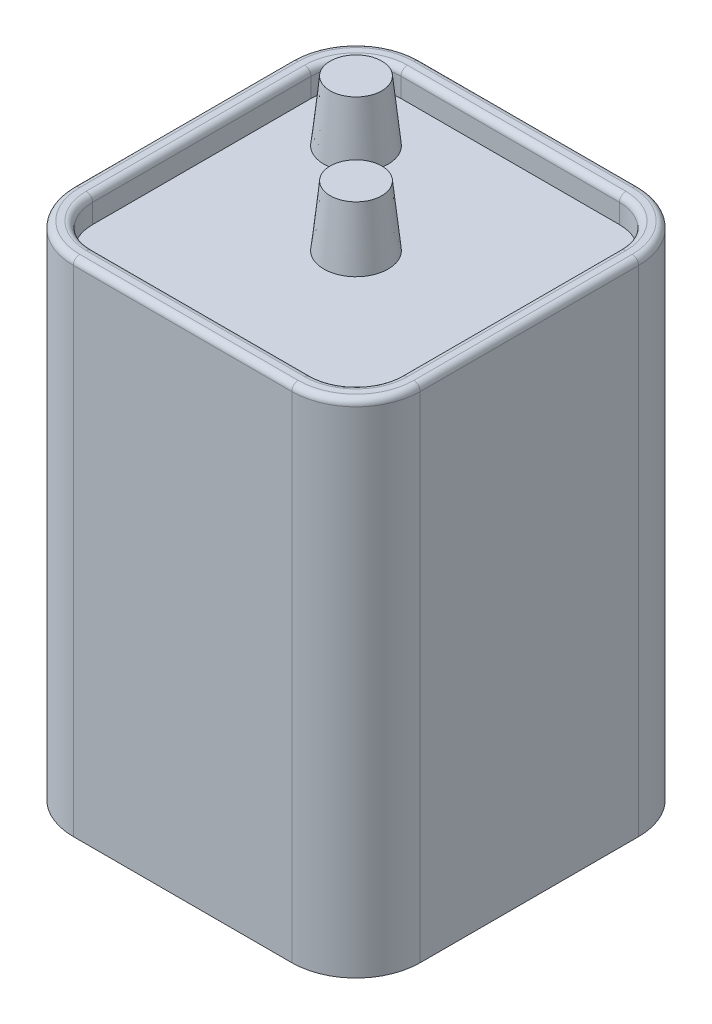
ISO-10303-21;
HEADER;
FILE_DESCRIPTION(('STEP AP214'),'2;1');
FILE_NAME('part.step','',(''),(''),'','','');
FILE_SCHEMA(('AUTOMOTIVE_DESIGN { 1 0 10303 214 1 1 1 1 }'));
ENDSEC;
DATA;
#1=APPLICATION_CONTEXT('core data for automotive mechanical design processes');
#2=APPLICATION_PROTOCOL_DEFINITION('international standard','automotive_design',2000,#1);
#3=PRODUCT_CONTEXT('',#1,'mechanical');
#4=PRODUCT('Part','Part','',(#3));
#5=PRODUCT_RELATED_PRODUCT_CATEGORY('part','',(#4));
#6=PRODUCT_DEFINITION_FORMATION('','',#4);
#7=PRODUCT_DEFINITION_CONTEXT('part definition',#1,'design');
#8=PRODUCT_DEFINITION('design','',#6,#7);
#9=PRODUCT_DEFINITION_SHAPE('','',#8);
#10=(LENGTH_UNIT() NAMED_UNIT(*) SI_UNIT(.MILLI.,.METRE.));
#11=(NAMED_UNIT(*) PLANE_ANGLE_UNIT() SI_UNIT($,.RADIAN.));
#12=(NAMED_UNIT(*) SI_UNIT($,.STERADIAN.) SOLID_ANGLE_UNIT());
#13=UNCERTAINTY_MEASURE_WITH_UNIT(LENGTH_MEASURE(1.E-05),#10,'distance_accuracy_value','');
#14=(GEOMETRIC_REPRESENTATION_CONTEXT(3) GLOBAL_UNCERTAINTY_ASSIGNED_CONTEXT((#13)) GLOBAL_UNIT_ASSIGNED_CONTEXT((#10,
#11,#12)) REPRESENTATION_CONTEXT('',''));
#15=CARTESIAN_POINT('',(0.,0.,0.));
#16=DIRECTION('',(0.,0.,1.));
#17=DIRECTION('',(1.,0.,0.));
#18=AXIS2_PLACEMENT_3D('',#15,#16,#17);
#19=CARTESIAN_POINT('',(34.29,99.06,34.29));
#20=DIRECTION('',(-1.,0.,0.));
#21=DIRECTION('',(0.,0.,1.));
#22=AXIS2_PLACEMENT_3D('',#19,#20,#21);
#23=PLANE('',#22);
#24=DIRECTION('',(0.,-1.,0.));
#25=VECTOR('',#24,1.);
#26=CARTESIAN_POINT('',(34.29,99.06,-21.59));
#27=LINE('',#26,#25);
#28=CARTESIAN_POINT('',(34.29,0.,-21.59));
#29=VERTEX_POINT('',#28);
#30=CARTESIAN_POINT('',(34.29,97.79,-21.59));
#31=VERTEX_POINT('',#30);
#32=EDGE_CURVE('E327',#29,#31,#27,.F.);
#33=ORIENTED_EDGE('',*,*,#32,.T.);
#34=DIRECTION('',(0.,0.,-1.));
#35=VECTOR('',#34,1.);
#36=CARTESIAN_POINT('',(34.29,97.79,34.29));
#37=LINE('',#36,#35);
#38=CARTESIAN_POINT('',(34.29,97.79,21.59));
#39=VERTEX_POINT('',#38);
#40=EDGE_CURVE('E395',#31,#39,#37,.F.);
#41=ORIENTED_EDGE('',*,*,#40,.T.);
#42=DIRECTION('',(0.,-1.,0.));
#43=VECTOR('',#42,1.);
#44=CARTESIAN_POINT('',(34.29,99.06,21.59));
#45=LINE('',#44,#43);
#46=CARTESIAN_POINT('',(34.29,0.,21.59));
#47=VERTEX_POINT('',#46);
#48=EDGE_CURVE('E331',#39,#47,#45,.T.);
#49=ORIENTED_EDGE('',*,*,#48,.T.);
#50=DIRECTION('',(0.,0.,-1.));
#51=VECTOR('',#50,1.);
#52=CARTESIAN_POINT('',(34.29,0.,34.29));
#53=LINE('',#52,#51);
#54=EDGE_CURVE('E264',#47,#29,#53,.T.);
#55=ORIENTED_EDGE('',*,*,#54,.T.);
#56=EDGE_LOOP('',(#33,#41,#49,#55));
#57=FACE_BOUND('',#56,.T.);
#58=ADVANCED_FACE('F45',(#57),#23,.F.);
#59=CARTESIAN_POINT('',(-34.29,99.06,-34.29));
#60=DIRECTION('',(0.,0.,1.));
#61=DIRECTION('',(1.,0.,0.));
#62=AXIS2_PLACEMENT_3D('',#59,#60,#61);
#63=PLANE('',#62);
#64=DIRECTION('',(0.,-1.,0.));
#65=VECTOR('',#64,1.);
#66=CARTESIAN_POINT('',(-21.59,99.06,-34.29));
#67=LINE('',#66,#65);
#68=CARTESIAN_POINT('',(-21.59,0.,-34.29));
#69=VERTEX_POINT('',#68);
#70=CARTESIAN_POINT('',(-21.59,97.79,-34.29));
#71=VERTEX_POINT('',#70);
#72=EDGE_CURVE('E323',#69,#71,#67,.F.);
#73=ORIENTED_EDGE('',*,*,#72,.T.);
#74=DIRECTION('',(-1.,0.,0.));
#75=VECTOR('',#74,1.);
#76=CARTESIAN_POINT('',(-34.29,97.79,-34.29));
#77=LINE('',#76,#75);
#78=CARTESIAN_POINT('',(21.59,97.79,-34.29));
#79=VERTEX_POINT('',#78);
#80=EDGE_CURVE('E413',#71,#79,#77,.F.);
#81=ORIENTED_EDGE('',*,*,#80,.T.);
#82=DIRECTION('',(0.,-1.,0.));
#83=VECTOR('',#82,1.);
#84=CARTESIAN_POINT('',(21.59,99.06,-34.29));
#85=LINE('',#84,#83);
#86=CARTESIAN_POINT('',(21.59,0.,-34.29));
#87=VERTEX_POINT('',#86);
#88=EDGE_CURVE('E320',#79,#87,#85,.T.);
#89=ORIENTED_EDGE('',*,*,#88,.T.);
#90=DIRECTION('',(-1.,0.,0.));
#91=VECTOR('',#90,1.);
#92=CARTESIAN_POINT('',(-34.29,0.,-34.29));
#93=LINE('',#92,#91);
#94=EDGE_CURVE('E289',#87,#69,#93,.T.);
#95=ORIENTED_EDGE('',*,*,#94,.T.);
#96=EDGE_LOOP('',(#73,#81,#89,#95));
#97=FACE_BOUND('',#96,.T.);
#98=ADVANCED_FACE('F537',(#97),#63,.F.);
#99=CARTESIAN_POINT('',(-34.29,99.06,34.29));
#100=DIRECTION('',(1.,0.,0.));
#101=DIRECTION('',(0.,0.,-1.));
#102=AXIS2_PLACEMENT_3D('',#99,#100,#101);
#103=PLANE('',#102);
#104=DIRECTION('',(0.,-1.,0.));
#105=VECTOR('',#104,1.);
#106=CARTESIAN_POINT('',(-34.29,99.06,21.59));
#107=LINE('',#106,#105);
#108=CARTESIAN_POINT('',(-34.29,0.,21.59));
#109=VERTEX_POINT('',#108);
#110=CARTESIAN_POINT('',(-34.29,97.79,21.59));
#111=VERTEX_POINT('',#110);
#112=EDGE_CURVE('E301',#109,#111,#107,.F.);
#113=ORIENTED_EDGE('',*,*,#112,.T.);
#114=DIRECTION('',(0.,0.,1.));
#115=VECTOR('',#114,1.);
#116=CARTESIAN_POINT('',(-34.29,97.79,34.29));
#117=LINE('',#116,#115);
#118=CARTESIAN_POINT('',(-34.29,97.79,-21.59));
#119=VERTEX_POINT('',#118);
#120=EDGE_CURVE('E407',#111,#119,#117,.F.);
#121=ORIENTED_EDGE('',*,*,#120,.T.);
#122=DIRECTION('',(0.,-1.,0.));
#123=VECTOR('',#122,1.);
#124=CARTESIAN_POINT('',(-34.29,99.06,-21.59));
#125=LINE('',#124,#123);
#126=CARTESIAN_POINT('',(-34.29,0.,-21.59));
#127=VERTEX_POINT('',#126);
#128=EDGE_CURVE('E305',#119,#127,#125,.T.);
#129=ORIENTED_EDGE('',*,*,#128,.T.);
#130=DIRECTION('',(0.,0.,1.));
#131=VECTOR('',#130,1.);
#132=CARTESIAN_POINT('',(-34.29,0.,34.29));
#133=LINE('',#132,#131);
#134=EDGE_CURVE('E293',#127,#109,#133,.T.);
#135=ORIENTED_EDGE('',*,*,#134,.T.);
#136=EDGE_LOOP('',(#113,#121,#129,#135));
#137=FACE_BOUND('',#136,.T.);
#138=ADVANCED_FACE('F544',(#137),#103,.F.);
#139=CARTESIAN_POINT('',(-34.29,99.06,34.29));
#140=DIRECTION('',(0.,0.,-1.));
#141=DIRECTION('',(-1.,0.,0.));
#142=AXIS2_PLACEMENT_3D('',#139,#140,#141);
#143=PLANE('',#142);
#144=DIRECTION('',(0.,-1.,0.));
#145=VECTOR('',#144,1.);
#146=CARTESIAN_POINT('',(21.59,99.06,34.29));
#147=LINE('',#146,#145);
#148=CARTESIAN_POINT('',(21.59,0.,34.29));
#149=VERTEX_POINT('',#148);
#150=CARTESIAN_POINT('',(21.59,97.79,34.29));
#151=VERTEX_POINT('',#150);
#152=EDGE_CURVE('E337',#149,#151,#147,.F.);
#153=ORIENTED_EDGE('',*,*,#152,.T.);
#154=DIRECTION('',(1.,0.,0.));
#155=VECTOR('',#154,1.);
#156=CARTESIAN_POINT('',(-34.29,97.79,34.29));
#157=LINE('',#156,#155);
#158=CARTESIAN_POINT('',(-21.59,97.79,34.29));
#159=VERTEX_POINT('',#158);
#160=EDGE_CURVE('E401',#151,#159,#157,.F.);
#161=ORIENTED_EDGE('',*,*,#160,.T.);
#162=DIRECTION('',(0.,-1.,0.));
#163=VECTOR('',#162,1.);
#164=CARTESIAN_POINT('',(-21.59,99.06,34.29));
#165=LINE('',#164,#163);
#166=CARTESIAN_POINT('',(-21.59,0.,34.29));
#167=VERTEX_POINT('',#166);
#168=EDGE_CURVE('E334',#159,#167,#165,.T.);
#169=ORIENTED_EDGE('',*,*,#168,.T.);
#170=DIRECTION('',(1.,0.,0.));
#171=VECTOR('',#170,1.);
#172=CARTESIAN_POINT('',(-34.29,0.,34.29));
#173=LINE('',#172,#171);
#174=EDGE_CURVE('E297',#167,#149,#173,.T.);
#175=ORIENTED_EDGE('',*,*,#174,.T.);
#176=EDGE_LOOP('',(#153,#161,#169,#175));
#177=FACE_BOUND('',#176,.T.);
#178=ADVANCED_FACE('F757',(#177),#143,.F.);
#179=CARTESIAN_POINT('',(0.,99.06,0.));
#180=DIRECTION('',(0.,-1.,0.));
#181=DIRECTION('',(0.,0.,-1.));
#182=AXIS2_PLACEMENT_3D('',#179,#180,#181);
#183=PLANE('',#182);
#184=DIRECTION('',(0.,0.,-1.));
#185=VECTOR('',#184,1.);
#186=CARTESIAN_POINT('',(33.02,99.06,0.));
#187=LINE('',#186,#185);
#188=CARTESIAN_POINT('',(33.02,99.06,21.59));
#189=VERTEX_POINT('',#188);
#190=CARTESIAN_POINT('',(33.02,99.06,-21.59));
#191=VERTEX_POINT('',#190);
#192=EDGE_CURVE('E384',#189,#191,#187,.T.);
#193=ORIENTED_EDGE('',*,*,#192,.T.);
#194=CARTESIAN_POINT('',(21.59,99.06,-21.59));
#195=DIRECTION('',(0.,-1.,0.));
#196=DIRECTION('',(0.,0.,-1.));
#197=AXIS2_PLACEMENT_3D('',#194,#195,#196);
#198=CIRCLE('',#197,11.43);
#199=CARTESIAN_POINT('',(21.59,99.06,-33.02));
#200=VERTEX_POINT('',#199);
#201=EDGE_CURVE('E387',#191,#200,#198,.F.);
#202=ORIENTED_EDGE('',*,*,#201,.T.);
#203=DIRECTION('',(-1.,0.,0.));
#204=VECTOR('',#203,1.);
#205=CARTESIAN_POINT('',(0.,99.06,-33.02));
#206=LINE('',#205,#204);
#207=CARTESIAN_POINT('',(-21.59,99.06,-33.02));
#208=VERTEX_POINT('',#207);
#209=EDGE_CURVE('E366',#200,#208,#206,.T.);
#210=ORIENTED_EDGE('',*,*,#209,.T.);
#211=CARTESIAN_POINT('',(-21.59,99.06,-21.59));
#212=DIRECTION('',(0.,-1.,0.));
#213=DIRECTION('',(0.,0.,-1.));
#214=AXIS2_PLACEMENT_3D('',#211,#212,#213);
#215=CIRCLE('',#214,11.43);
#216=CARTESIAN_POINT('',(-33.02,99.06,-21.59));
#217=VERTEX_POINT('',#216);
#218=EDGE_CURVE('E369',#208,#217,#215,.F.);
#219=ORIENTED_EDGE('',*,*,#218,.T.);
#220=DIRECTION('',(0.,0.,1.));
#221=VECTOR('',#220,1.);
#222=CARTESIAN_POINT('',(-33.02,99.06,0.));
#223=LINE('',#222,#221);
#224=CARTESIAN_POINT('',(-33.02,99.06,21.59));
#225=VERTEX_POINT('',#224);
#226=EDGE_CURVE('E372',#217,#225,#223,.T.);
#227=ORIENTED_EDGE('',*,*,#226,.T.);
#228=CARTESIAN_POINT('',(-21.59,99.06,21.59));
#229=DIRECTION('',(0.,-1.,0.));
#230=DIRECTION('',(0.,0.,-1.));
#231=AXIS2_PLACEMENT_3D('',#228,#229,#230);
#232=CIRCLE('',#231,11.43);
#233=CARTESIAN_POINT('',(-21.59,99.06,33.02));
#234=VERTEX_POINT('',#233);
#235=EDGE_CURVE('E375',#225,#234,#232,.F.);
#236=ORIENTED_EDGE('',*,*,#235,.T.);
#237=DIRECTION('',(1.,0.,0.));
#238=VECTOR('',#237,1.);
#239=CARTESIAN_POINT('',(0.,99.06,33.02));
#240=LINE('',#239,#238);
#241=CARTESIAN_POINT('',(21.59,99.06,33.02));
#242=VERTEX_POINT('',#241);
#243=EDGE_CURVE('E378',#234,#242,#240,.T.);
#244=ORIENTED_EDGE('',*,*,#243,.T.);
#245=CARTESIAN_POINT('',(21.59,99.06,21.59));
#246=DIRECTION('',(0.,-1.,0.));
#247=DIRECTION('',(0.,0.,-1.));
#248=AXIS2_PLACEMENT_3D('',#245,#246,#247);
#249=CIRCLE('',#248,11.43);
#250=EDGE_CURVE('E381',#242,#189,#249,.F.);
#251=ORIENTED_EDGE('',*,*,#250,.T.);
#252=EDGE_LOOP('',(#193,#202,#210,#219,#227,#236,#244,#251));
#253=FACE_BOUND('',#252,.T.);
#254=DIRECTION('',(0.,0.,1.));
#255=VECTOR('',#254,1.);
#256=CARTESIAN_POINT('',(-31.75,99.06,0.));
#257=LINE('',#256,#255);
#258=CARTESIAN_POINT('',(-31.75,99.06,21.59));
#259=VERTEX_POINT('',#258);
#260=CARTESIAN_POINT('',(-31.75,99.06,-21.59));
#261=VERTEX_POINT('',#260);
#262=EDGE_CURVE('E359',#259,#261,#257,.F.);
#263=ORIENTED_EDGE('',*,*,#262,.T.);
#264=CARTESIAN_POINT('',(-21.59,99.06,-21.59));
#265=DIRECTION('',(0.,-1.,0.));
#266=DIRECTION('',(0.,0.,-1.));
#267=AXIS2_PLACEMENT_3D('',#264,#265,#266);
#268=CIRCLE('',#267,10.16);
#269=CARTESIAN_POINT('',(-21.59,99.06,-31.75));
#270=VERTEX_POINT('',#269);
#271=EDGE_CURVE('E362',#261,#270,#268,.T.);
#272=ORIENTED_EDGE('',*,*,#271,.T.);
#273=DIRECTION('',(-1.,0.,0.));
#274=VECTOR('',#273,1.);
#275=CARTESIAN_POINT('',(0.,99.06,-31.75));
#276=LINE('',#275,#274);
#277=CARTESIAN_POINT('',(21.59,99.06,-31.75));
#278=VERTEX_POINT('',#277);
#279=EDGE_CURVE('E341',#270,#278,#276,.F.);
#280=ORIENTED_EDGE('',*,*,#279,.T.);
#281=CARTESIAN_POINT('',(21.59,99.06,-21.59));
#282=DIRECTION('',(0.,-1.,0.));
#283=DIRECTION('',(0.,0.,-1.));
#284=AXIS2_PLACEMENT_3D('',#281,#282,#283);
#285=CIRCLE('',#284,10.16);
#286=CARTESIAN_POINT('',(31.75,99.06,-21.59));
#287=VERTEX_POINT('',#286);
#288=EDGE_CURVE('E344',#278,#287,#285,.T.);
#289=ORIENTED_EDGE('',*,*,#288,.T.);
#290=DIRECTION('',(0.,0.,-1.));
#291=VECTOR('',#290,1.);
#292=CARTESIAN_POINT('',(31.75,99.06,0.));
#293=LINE('',#292,#291);
#294=CARTESIAN_POINT('',(31.75,99.06,21.59));
#295=VERTEX_POINT('',#294);
#296=EDGE_CURVE('E347',#287,#295,#293,.F.);
#297=ORIENTED_EDGE('',*,*,#296,.T.);
#298=CARTESIAN_POINT('',(21.59,99.06,21.59));
#299=DIRECTION('',(0.,-1.,0.));
#300=DIRECTION('',(0.,0.,-1.));
#301=AXIS2_PLACEMENT_3D('',#298,#299,#300);
#302=CIRCLE('',#301,10.16);
#303=CARTESIAN_POINT('',(21.59,99.06,31.75));
#304=VERTEX_POINT('',#303);
#305=EDGE_CURVE('E350',#295,#304,#302,.T.);
#306=ORIENTED_EDGE('',*,*,#305,.T.);
#307=DIRECTION('',(1.,0.,0.));
#308=VECTOR('',#307,1.);
#309=CARTESIAN_POINT('',(0.,99.06,31.75));
#310=LINE('',#309,#308);
#311=CARTESIAN_POINT('',(-21.59,99.06,31.75));
#312=VERTEX_POINT('',#311);
#313=EDGE_CURVE('E353',#304,#312,#310,.F.);
#314=ORIENTED_EDGE('',*,*,#313,.T.);
#315=CARTESIAN_POINT('',(-21.59,99.06,21.59));
#316=DIRECTION('',(0.,-1.,0.));
#317=DIRECTION('',(0.,0.,-1.));
#318=AXIS2_PLACEMENT_3D('',#315,#316,#317);
#319=CIRCLE('',#318,10.16);
#320=EDGE_CURVE('E356',#312,#259,#319,.T.);
#321=ORIENTED_EDGE('',*,*,#320,.T.);
#322=EDGE_LOOP('',(#263,#272,#280,#289,#297,#306,#314,#321));
#323=FACE_BOUND('',#322,.T.);
#324=ADVANCED_FACE('F500',(#253,#323),#183,.F.);
#325=CARTESIAN_POINT('',(0.,0.,0.));
#326=DIRECTION('',(0.,-1.,0.));
#327=DIRECTION('',(0.,0.,-1.));
#328=AXIS2_PLACEMENT_3D('',#325,#326,#327);
#329=PLANE('',#328);
#330=ORIENTED_EDGE('',*,*,#134,.F.);
#331=CARTESIAN_POINT('',(-21.59,0.,-21.59));
#332=DIRECTION('',(0.,-1.,0.));
#333=DIRECTION('',(0.,0.,-1.));
#334=AXIS2_PLACEMENT_3D('',#331,#332,#333);
#335=CIRCLE('',#334,12.7);
#336=EDGE_CURVE('E317',#127,#69,#335,.T.);
#337=ORIENTED_EDGE('',*,*,#336,.T.);
#338=ORIENTED_EDGE('',*,*,#94,.F.);
#339=CARTESIAN_POINT('',(21.59,0.,-21.59));
#340=DIRECTION('',(0.,-1.,0.));
#341=DIRECTION('',(0.,0.,-1.));
#342=AXIS2_PLACEMENT_3D('',#339,#340,#341);
#343=CIRCLE('',#342,12.7);
#344=EDGE_CURVE('E311',#87,#29,#343,.T.);
#345=ORIENTED_EDGE('',*,*,#344,.T.);
#346=ORIENTED_EDGE('',*,*,#54,.F.);
#347=CARTESIAN_POINT('',(21.59,0.,21.59));
#348=DIRECTION('',(0.,-1.,0.));
#349=DIRECTION('',(0.,0.,-1.));
#350=AXIS2_PLACEMENT_3D('',#347,#348,#349);
#351=CIRCLE('',#350,12.7);
#352=EDGE_CURVE('E314',#47,#149,#351,.T.);
#353=ORIENTED_EDGE('',*,*,#352,.T.);
#354=ORIENTED_EDGE('',*,*,#174,.F.);
#355=CARTESIAN_POINT('',(-21.59,0.,21.59));
#356=DIRECTION('',(0.,-1.,0.));
#357=DIRECTION('',(0.,0.,-1.));
#358=AXIS2_PLACEMENT_3D('',#355,#356,#357);
#359=CIRCLE('',#358,12.7);
#360=EDGE_CURVE('E308',#167,#109,#359,.T.);
#361=ORIENTED_EDGE('',*,*,#360,.T.);
#362=EDGE_LOOP('',(#330,#337,#338,#345,#346,#353,#354,#361));
#363=FACE_BOUND('',#362,.T.);
#364=ADVANCED_FACE('F553',(#363),#329,.T.);
#365=CARTESIAN_POINT('',(-21.59,99.06,-21.59));
#366=DIRECTION('',(0.,-1.,0.));
#367=DIRECTION('',(0.,0.,-1.));
#368=AXIS2_PLACEMENT_3D('',#365,#366,#367);
#369=CYLINDRICAL_SURFACE('',#368,12.7);
#370=ORIENTED_EDGE('',*,*,#128,.F.);
#371=CARTESIAN_POINT('',(-21.59,97.79,-21.59));
#372=DIRECTION('',(0.,-1.,0.));
#373=DIRECTION('',(0.,0.,-1.));
#374=AXIS2_PLACEMENT_3D('',#371,#372,#373);
#375=CIRCLE('',#374,12.7);
#376=EDGE_CURVE('E410',#119,#71,#375,.T.);
#377=ORIENTED_EDGE('',*,*,#376,.T.);
#378=ORIENTED_EDGE('',*,*,#72,.F.);
#379=ORIENTED_EDGE('',*,*,#336,.F.);
#380=EDGE_LOOP('',(#370,#377,#378,#379));
#381=FACE_BOUND('',#380,.T.);
#382=ADVANCED_FACE('F549',(#381),#369,.T.);
#383=CARTESIAN_POINT('',(21.59,99.06,21.59));
#384=DIRECTION('',(0.,-1.,0.));
#385=DIRECTION('',(0.,0.,-1.));
#386=AXIS2_PLACEMENT_3D('',#383,#384,#385);
#387=CYLINDRICAL_SURFACE('',#386,12.7);
#388=ORIENTED_EDGE('',*,*,#48,.F.);
#389=CARTESIAN_POINT('',(21.59,97.79,21.59));
#390=DIRECTION('',(0.,-1.,0.));
#391=DIRECTION('',(0.,0.,-1.));
#392=AXIS2_PLACEMENT_3D('',#389,#390,#391);
#393=CIRCLE('',#392,12.7);
#394=EDGE_CURVE('E398',#39,#151,#393,.T.);
#395=ORIENTED_EDGE('',*,*,#394,.T.);
#396=ORIENTED_EDGE('',*,*,#152,.F.);
#397=ORIENTED_EDGE('',*,*,#352,.F.);
#398=EDGE_LOOP('',(#388,#395,#396,#397));
#399=FACE_BOUND('',#398,.T.);
#400=ADVANCED_FACE('F552',(#399),#387,.T.);
#401=CARTESIAN_POINT('',(21.59,99.06,-21.59));
#402=DIRECTION('',(0.,-1.,0.));
#403=DIRECTION('',(0.,0.,-1.));
#404=AXIS2_PLACEMENT_3D('',#401,#402,#403);
#405=CYLINDRICAL_SURFACE('',#404,12.7);
#406=ORIENTED_EDGE('',*,*,#88,.F.);
#407=CARTESIAN_POINT('',(21.59,97.79,-21.59));
#408=DIRECTION('',(0.,-1.,0.));
#409=DIRECTION('',(0.,0.,-1.));
#410=AXIS2_PLACEMENT_3D('',#407,#408,#409);
#411=CIRCLE('',#410,12.7);
#412=EDGE_CURVE('E391',#79,#31,#411,.T.);
#413=ORIENTED_EDGE('',*,*,#412,.T.);
#414=ORIENTED_EDGE('',*,*,#32,.F.);
#415=ORIENTED_EDGE('',*,*,#344,.F.);
#416=EDGE_LOOP('',(#406,#413,#414,#415));
#417=FACE_BOUND('',#416,.T.);
#418=ADVANCED_FACE('F557',(#417),#405,.T.);
#419=CARTESIAN_POINT('',(-21.59,99.06,21.59));
#420=DIRECTION('',(0.,-1.,0.));
#421=DIRECTION('',(0.,0.,-1.));
#422=AXIS2_PLACEMENT_3D('',#419,#420,#421);
#423=CYLINDRICAL_SURFACE('',#422,12.7);
#424=ORIENTED_EDGE('',*,*,#168,.F.);
#425=CARTESIAN_POINT('',(-21.59,97.79,21.59));
#426=DIRECTION('',(0.,-1.,0.));
#427=DIRECTION('',(0.,0.,-1.));
#428=AXIS2_PLACEMENT_3D('',#425,#426,#427);
#429=CIRCLE('',#428,12.7);
#430=EDGE_CURVE('E404',#159,#111,#429,.T.);
#431=ORIENTED_EDGE('',*,*,#430,.T.);
#432=ORIENTED_EDGE('',*,*,#112,.F.);
#433=ORIENTED_EDGE('',*,*,#360,.F.);
#434=EDGE_LOOP('',(#424,#431,#432,#433));
#435=FACE_BOUND('',#434,.T.);
#436=ADVANCED_FACE('F561',(#435),#423,.T.);
#437=CARTESIAN_POINT('',(21.59,93.98,-21.59));
#438=DIRECTION('',(0.,1.,0.));
#439=DIRECTION('',(0.,0.,1.));
#440=AXIS2_PLACEMENT_3D('',#437,#438,#439);
#441=CYLINDRICAL_SURFACE('',#440,8.89);
#442=DIRECTION('',(0.,1.,0.));
#443=VECTOR('',#442,1.);
#444=CARTESIAN_POINT('',(30.48,93.98,-21.59));
#445=LINE('',#444,#443);
#446=CARTESIAN_POINT('',(30.48,93.98,-21.59));
#447=VERTEX_POINT('',#446);
#448=CARTESIAN_POINT('',(30.48,97.79,-21.59));
#449=VERTEX_POINT('',#448);
#450=EDGE_CURVE('E261',#447,#449,#445,.T.);
#451=ORIENTED_EDGE('',*,*,#450,.T.);
#452=CARTESIAN_POINT('',(21.59,97.79,-21.59));
#453=DIRECTION('',(0.,-1.,0.));
#454=DIRECTION('',(0.,0.,-1.));
#455=AXIS2_PLACEMENT_3D('',#452,#453,#454);
#456=CIRCLE('',#455,8.89);
#457=CARTESIAN_POINT('',(21.59,97.79,-30.48));
#458=VERTEX_POINT('',#457);
#459=EDGE_CURVE('E55',#449,#458,#456,.F.);
#460=ORIENTED_EDGE('',*,*,#459,.T.);
#461=DIRECTION('',(0.,1.,0.));
#462=VECTOR('',#461,1.);
#463=CARTESIAN_POINT('',(21.59,93.98,-30.48));
#464=LINE('',#463,#462);
#465=CARTESIAN_POINT('',(21.59,93.98,-30.48));
#466=VERTEX_POINT('',#465);
#467=EDGE_CURVE('E206',#466,#458,#464,.T.);
#468=ORIENTED_EDGE('',*,*,#467,.F.);
#469=CARTESIAN_POINT('',(21.59,93.98,-21.59));
#470=DIRECTION('',(0.,1.,0.));
#471=DIRECTION('',(0.,0.,1.));
#472=AXIS2_PLACEMENT_3D('',#469,#470,#471);
#473=CIRCLE('',#472,8.89);
#474=EDGE_CURVE('E210',#447,#466,#473,.T.);
#475=ORIENTED_EDGE('',*,*,#474,.F.);
#476=EDGE_LOOP('',(#451,#460,#468,#475));
#477=FACE_BOUND('',#476,.T.);
#478=ADVANCED_FACE('F208',(#477),#441,.F.);
#479=CARTESIAN_POINT('',(30.48,93.98,21.59));
#480=DIRECTION('',(1.,0.,0.));
#481=DIRECTION('',(0.,0.,-1.));
#482=AXIS2_PLACEMENT_3D('',#479,#480,#481);
#483=PLANE('',#482);
#484=DIRECTION('',(0.,1.,0.));
#485=VECTOR('',#484,1.);
#486=CARTESIAN_POINT('',(30.48,93.98,21.59));
#487=LINE('',#486,#485);
#488=CARTESIAN_POINT('',(30.48,93.98,21.59));
#489=VERTEX_POINT('',#488);
#490=CARTESIAN_POINT('',(30.48,97.79,21.59));
#491=VERTEX_POINT('',#490);
#492=EDGE_CURVE('E265',#489,#491,#487,.T.);
#493=ORIENTED_EDGE('',*,*,#492,.T.);
#494=DIRECTION('',(0.,0.,-1.));
#495=VECTOR('',#494,1.);
#496=CARTESIAN_POINT('',(30.48,97.79,21.59));
#497=LINE('',#496,#495);
#498=EDGE_CURVE('E70',#491,#449,#497,.T.);
#499=ORIENTED_EDGE('',*,*,#498,.T.);
#500=ORIENTED_EDGE('',*,*,#450,.F.);
#501=DIRECTION('',(0.,0.,-1.));
#502=VECTOR('',#501,1.);
#503=CARTESIAN_POINT('',(30.48,93.98,21.59));
#504=LINE('',#503,#502);
#505=EDGE_CURVE('E216',#489,#447,#504,.T.);
#506=ORIENTED_EDGE('',*,*,#505,.F.);
#507=EDGE_LOOP('',(#493,#499,#500,#506));
#508=FACE_BOUND('',#507,.T.);
#509=ADVANCED_FACE('F526',(#508),#483,.F.);
#510=CARTESIAN_POINT('',(21.59,93.98,21.59));
#511=DIRECTION('',(0.,1.,0.));
#512=DIRECTION('',(0.,0.,1.));
#513=AXIS2_PLACEMENT_3D('',#510,#511,#512);
#514=CYLINDRICAL_SURFACE('',#513,8.89);
#515=DIRECTION('',(0.,1.,0.));
#516=VECTOR('',#515,1.);
#517=CARTESIAN_POINT('',(21.59,93.98,30.48));
#518=LINE('',#517,#516);
#519=CARTESIAN_POINT('',(21.59,93.98,30.48));
#520=VERTEX_POINT('',#519);
#521=CARTESIAN_POINT('',(21.59,97.79,30.48));
#522=VERTEX_POINT('',#521);
#523=EDGE_CURVE('E268',#520,#522,#518,.T.);
#524=ORIENTED_EDGE('',*,*,#523,.T.);
#525=CARTESIAN_POINT('',(21.59,97.79,21.59));
#526=DIRECTION('',(0.,-1.,0.));
#527=DIRECTION('',(0.,0.,-1.));
#528=AXIS2_PLACEMENT_3D('',#525,#526,#527);
#529=CIRCLE('',#528,8.89);
#530=EDGE_CURVE('E429',#522,#491,#529,.F.);
#531=ORIENTED_EDGE('',*,*,#530,.T.);
#532=ORIENTED_EDGE('',*,*,#492,.F.);
#533=CARTESIAN_POINT('',(21.59,93.98,21.59));
#534=DIRECTION('',(0.,1.,0.));
#535=DIRECTION('',(0.,0.,1.));
#536=AXIS2_PLACEMENT_3D('',#533,#534,#535);
#537=CIRCLE('',#536,8.89);
#538=EDGE_CURVE('E256',#520,#489,#537,.T.);
#539=ORIENTED_EDGE('',*,*,#538,.F.);
#540=EDGE_LOOP('',(#524,#531,#532,#539));
#541=FACE_BOUND('',#540,.T.);
#542=ADVANCED_FACE('F527',(#541),#514,.F.);
#543=CARTESIAN_POINT('',(-21.59,93.98,30.48));
#544=DIRECTION('',(0.,0.,1.));
#545=DIRECTION('',(1.,0.,0.));
#546=AXIS2_PLACEMENT_3D('',#543,#544,#545);
#547=PLANE('',#546);
#548=DIRECTION('',(0.,1.,0.));
#549=VECTOR('',#548,1.);
#550=CARTESIAN_POINT('',(-21.59,93.98,30.48));
#551=LINE('',#550,#549);
#552=CARTESIAN_POINT('',(-21.59,93.98,30.48));
#553=VERTEX_POINT('',#552);
#554=CARTESIAN_POINT('',(-21.59,97.79,30.48));
#555=VERTEX_POINT('',#554);
#556=EDGE_CURVE('E272',#553,#555,#551,.T.);
#557=ORIENTED_EDGE('',*,*,#556,.T.);
#558=DIRECTION('',(1.,0.,0.));
#559=VECTOR('',#558,1.);
#560=CARTESIAN_POINT('',(-21.59,97.79,30.48));
#561=LINE('',#560,#559);
#562=EDGE_CURVE('E426',#555,#522,#561,.T.);
#563=ORIENTED_EDGE('',*,*,#562,.T.);
#564=ORIENTED_EDGE('',*,*,#523,.F.);
#565=DIRECTION('',(1.,0.,0.));
#566=VECTOR('',#565,1.);
#567=CARTESIAN_POINT('',(-21.59,93.98,30.48));
#568=LINE('',#567,#566);
#569=EDGE_CURVE('E252',#553,#520,#568,.T.);
#570=ORIENTED_EDGE('',*,*,#569,.F.);
#571=EDGE_LOOP('',(#557,#563,#564,#570));
#572=FACE_BOUND('',#571,.T.);
#573=ADVANCED_FACE('F523',(#572),#547,.F.);
#574=CARTESIAN_POINT('',(-21.59,93.98,21.59));
#575=DIRECTION('',(0.,1.,0.));
#576=DIRECTION('',(0.,0.,1.));
#577=AXIS2_PLACEMENT_3D('',#574,#575,#576);
#578=CYLINDRICAL_SURFACE('',#577,8.89);
#579=DIRECTION('',(0.,1.,0.));
#580=VECTOR('',#579,1.);
#581=CARTESIAN_POINT('',(-30.48,93.98,21.59));
#582=LINE('',#581,#580);
#583=CARTESIAN_POINT('',(-30.48,93.98,21.59));
#584=VERTEX_POINT('',#583);
#585=CARTESIAN_POINT('',(-30.48,97.79,21.59));
#586=VERTEX_POINT('',#585);
#587=EDGE_CURVE('E276',#584,#586,#582,.T.);
#588=ORIENTED_EDGE('',*,*,#587,.T.);
#589=CARTESIAN_POINT('',(-21.59,97.79,21.59));
#590=DIRECTION('',(0.,-1.,0.));
#591=DIRECTION('',(0.,0.,-1.));
#592=AXIS2_PLACEMENT_3D('',#589,#590,#591);
#593=CIRCLE('',#592,8.89);
#594=EDGE_CURVE('E423',#586,#555,#593,.F.);
#595=ORIENTED_EDGE('',*,*,#594,.T.);
#596=ORIENTED_EDGE('',*,*,#556,.F.);
#597=CARTESIAN_POINT('',(-21.59,93.98,21.59));
#598=DIRECTION('',(0.,1.,0.));
#599=DIRECTION('',(0.,0.,1.));
#600=AXIS2_PLACEMENT_3D('',#597,#598,#599);
#601=CIRCLE('',#600,8.89);
#602=EDGE_CURVE('E248',#584,#553,#601,.T.);
#603=ORIENTED_EDGE('',*,*,#602,.F.);
#604=EDGE_LOOP('',(#588,#595,#596,#603));
#605=FACE_BOUND('',#604,.T.);
#606=ADVANCED_FACE('F520',(#605),#578,.F.);
#607=CARTESIAN_POINT('',(-30.48,93.98,-21.59));
#608=DIRECTION('',(-1.,0.,0.));
#609=DIRECTION('',(0.,0.,1.));
#610=AXIS2_PLACEMENT_3D('',#607,#608,#609);
#611=PLANE('',#610);
#612=DIRECTION('',(0.,1.,0.));
#613=VECTOR('',#612,1.);
#614=CARTESIAN_POINT('',(-30.48,93.98,-21.59));
#615=LINE('',#614,#613);
#616=CARTESIAN_POINT('',(-30.48,93.98,-21.59));
#617=VERTEX_POINT('',#616);
#618=CARTESIAN_POINT('',(-30.48,97.79,-21.59));
#619=VERTEX_POINT('',#618);
#620=EDGE_CURVE('E280',#617,#619,#615,.T.);
#621=ORIENTED_EDGE('',*,*,#620,.T.);
#622=DIRECTION('',(0.,0.,1.));
#623=VECTOR('',#622,1.);
#624=CARTESIAN_POINT('',(-30.48,97.79,-21.59));
#625=LINE('',#624,#623);
#626=EDGE_CURVE('E420',#619,#586,#625,.T.);
#627=ORIENTED_EDGE('',*,*,#626,.T.);
#628=ORIENTED_EDGE('',*,*,#587,.F.);
#629=DIRECTION('',(0.,0.,1.));
#630=VECTOR('',#629,1.);
#631=CARTESIAN_POINT('',(-30.48,93.98,-21.59));
#632=LINE('',#631,#630);
#633=EDGE_CURVE('E244',#617,#584,#632,.T.);
#634=ORIENTED_EDGE('',*,*,#633,.F.);
#635=EDGE_LOOP('',(#621,#627,#628,#634));
#636=FACE_BOUND('',#635,.T.);
#637=ADVANCED_FACE('F516',(#636),#611,.F.);
#638=CARTESIAN_POINT('',(-21.59,93.98,-21.59));
#639=DIRECTION('',(0.,1.,0.));
#640=DIRECTION('',(0.,0.,1.));
#641=AXIS2_PLACEMENT_3D('',#638,#639,#640);
#642=CYLINDRICAL_SURFACE('',#641,8.89);
#643=DIRECTION('',(0.,1.,0.));
#644=VECTOR('',#643,1.);
#645=CARTESIAN_POINT('',(-21.59,93.98,-30.48));
#646=LINE('',#645,#644);
#647=CARTESIAN_POINT('',(-21.59,93.98,-30.48));
#648=VERTEX_POINT('',#647);
#649=CARTESIAN_POINT('',(-21.59,97.79,-30.48));
#650=VERTEX_POINT('',#649);
#651=EDGE_CURVE('E215',#648,#650,#646,.T.);
#652=ORIENTED_EDGE('',*,*,#651,.T.);
#653=CARTESIAN_POINT('',(-21.59,97.79,-21.59));
#654=DIRECTION('',(0.,-1.,0.));
#655=DIRECTION('',(0.,0.,-1.));
#656=AXIS2_PLACEMENT_3D('',#653,#654,#655);
#657=CIRCLE('',#656,8.89);
#658=EDGE_CURVE('E416',#650,#619,#657,.F.);
#659=ORIENTED_EDGE('',*,*,#658,.T.);
#660=ORIENTED_EDGE('',*,*,#620,.F.);
#661=CARTESIAN_POINT('',(-21.59,93.98,-21.59));
#662=DIRECTION('',(0.,1.,0.));
#663=DIRECTION('',(0.,0.,1.));
#664=AXIS2_PLACEMENT_3D('',#661,#662,#663);
#665=CIRCLE('',#664,8.89);
#666=EDGE_CURVE('E226',#648,#617,#665,.T.);
#667=ORIENTED_EDGE('',*,*,#666,.F.);
#668=EDGE_LOOP('',(#652,#659,#660,#667));
#669=FACE_BOUND('',#668,.T.);
#670=ADVANCED_FACE('F512',(#669),#642,.F.);
#671=CARTESIAN_POINT('',(21.59,93.98,-30.48));
#672=DIRECTION('',(0.,0.,-1.));
#673=DIRECTION('',(-1.,0.,0.));
#674=AXIS2_PLACEMENT_3D('',#671,#672,#673);
#675=PLANE('',#674);
#676=ORIENTED_EDGE('',*,*,#467,.T.);
#677=DIRECTION('',(-1.,0.,0.));
#678=VECTOR('',#677,1.);
#679=CARTESIAN_POINT('',(21.59,97.79,-30.48));
#680=LINE('',#679,#678);
#681=EDGE_CURVE('E11',#458,#650,#680,.T.);
#682=ORIENTED_EDGE('',*,*,#681,.T.);
#683=ORIENTED_EDGE('',*,*,#651,.F.);
#684=DIRECTION('',(-1.,0.,0.));
#685=VECTOR('',#684,1.);
#686=CARTESIAN_POINT('',(21.59,93.98,-30.48));
#687=LINE('',#686,#685);
#688=EDGE_CURVE('E219',#466,#648,#687,.T.);
#689=ORIENTED_EDGE('',*,*,#688,.F.);
#690=EDGE_LOOP('',(#676,#682,#683,#689));
#691=FACE_BOUND('',#690,.T.);
#692=ADVANCED_FACE('F220',(#691),#675,.F.);
#693=CARTESIAN_POINT('',(21.59,93.98,-21.59));
#694=DIRECTION('',(0.,1.,0.));
#695=DIRECTION('',(0.,0.,1.));
#696=AXIS2_PLACEMENT_3D('',#693,#694,#695);
#697=PLANE('',#696);
#698=CARTESIAN_POINT('',(-17.9605122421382,93.98,-17.9605122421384));
#699=DIRECTION('',(0.,1.,0.));
#700=DIRECTION('',(0.,0.,1.));
#701=AXIS2_PLACEMENT_3D('',#698,#699,#700);
#702=CIRCLE('',#701,6.35);
#703=CARTESIAN_POINT('',(-17.9605122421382,93.98,-11.6105122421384));
#704=VERTEX_POINT('',#703);
#705=EDGE_CURVE('E933',#704,#704,#702,.T.);
#706=ORIENTED_EDGE('',*,*,#705,.F.);
#707=EDGE_LOOP('',(#706));
#708=FACE_BOUND('',#707,.T.);
#709=CARTESIAN_POINT('',(0.,93.98,0.));
#710=DIRECTION('',(0.,1.,0.));
#711=DIRECTION('',(0.,0.,1.));
#712=AXIS2_PLACEMENT_3D('',#709,#710,#711);
#713=CIRCLE('',#712,6.35);
#714=CARTESIAN_POINT('',(0.,93.98,6.35));
#715=VERTEX_POINT('',#714);
#716=EDGE_CURVE('E932',#715,#715,#713,.T.);
#717=ORIENTED_EDGE('',*,*,#716,.F.);
#718=EDGE_LOOP('',(#717));
#719=FACE_BOUND('',#718,.T.);
#720=ORIENTED_EDGE('',*,*,#474,.T.);
#721=ORIENTED_EDGE('',*,*,#688,.T.);
#722=ORIENTED_EDGE('',*,*,#666,.T.);
#723=ORIENTED_EDGE('',*,*,#633,.T.);
#724=ORIENTED_EDGE('',*,*,#602,.T.);
#725=ORIENTED_EDGE('',*,*,#569,.T.);
#726=ORIENTED_EDGE('',*,*,#538,.T.);
#727=ORIENTED_EDGE('',*,*,#505,.T.);
#728=EDGE_LOOP('',(#720,#721,#722,#723,#724,#725,#726,#727));
#729=FACE_BOUND('',#728,.T.);
#730=ADVANCED_FACE('F228',(#708,#719,#729),#697,.T.);
#731=CARTESIAN_POINT('',(-21.59,97.79,21.59));
#732=DIRECTION('',(0.,-1.,0.));
#733=DIRECTION('',(0.,0.,-1.));
#734=AXIS2_PLACEMENT_3D('',#731,#732,#733);
#735=TOROIDAL_SURFACE('',#734,11.43,1.27);
#736=CARTESIAN_POINT('',(-33.02,97.79,21.59));
#737=DIRECTION('',(0.,0.,-1.));
#738=DIRECTION('',(-1.,0.,0.));
#739=AXIS2_PLACEMENT_3D('',#736,#737,#738);
#740=CIRCLE('',#739,1.27);
#741=EDGE_CURVE('E236',#111,#225,#740,.T.);
#742=ORIENTED_EDGE('',*,*,#741,.F.);
#743=ORIENTED_EDGE('',*,*,#430,.F.);
#744=CARTESIAN_POINT('',(-21.59,97.79,33.02));
#745=DIRECTION('',(1.,0.,0.));
#746=DIRECTION('',(0.,0.,-1.));
#747=AXIS2_PLACEMENT_3D('',#744,#745,#746);
#748=CIRCLE('',#747,1.27);
#749=EDGE_CURVE('E232',#234,#159,#748,.T.);
#750=ORIENTED_EDGE('',*,*,#749,.F.);
#751=ORIENTED_EDGE('',*,*,#235,.F.);
#752=EDGE_LOOP('',(#742,#743,#750,#751));
#753=FACE_BOUND('',#752,.T.);
#754=ADVANCED_FACE('F593',(#753),#735,.T.);
#755=CARTESIAN_POINT('',(0.,97.79,33.02));
#756=DIRECTION('',(1.,0.,0.));
#757=DIRECTION('',(0.,0.,-1.));
#758=AXIS2_PLACEMENT_3D('',#755,#756,#757);
#759=CYLINDRICAL_SURFACE('',#758,1.27);
#760=ORIENTED_EDGE('',*,*,#749,.T.);
#761=ORIENTED_EDGE('',*,*,#160,.F.);
#762=CARTESIAN_POINT('',(21.59,97.79,33.02));
#763=DIRECTION('',(1.,0.,0.));
#764=DIRECTION('',(0.,0.,-1.));
#765=AXIS2_PLACEMENT_3D('',#762,#763,#764);
#766=CIRCLE('',#765,1.27);
#767=EDGE_CURVE('E454',#242,#151,#766,.T.);
#768=ORIENTED_EDGE('',*,*,#767,.F.);
#769=ORIENTED_EDGE('',*,*,#243,.F.);
#770=EDGE_LOOP('',(#760,#761,#768,#769));
#771=FACE_BOUND('',#770,.T.);
#772=ADVANCED_FACE('F589',(#771),#759,.T.);
#773=CARTESIAN_POINT('',(-33.02,97.79,0.));
#774=DIRECTION('',(0.,0.,1.));
#775=DIRECTION('',(1.,0.,0.));
#776=AXIS2_PLACEMENT_3D('',#773,#774,#775);
#777=CYLINDRICAL_SURFACE('',#776,1.27);
#778=ORIENTED_EDGE('',*,*,#741,.T.);
#779=ORIENTED_EDGE('',*,*,#226,.F.);
#780=CARTESIAN_POINT('',(-33.02,97.79,-21.59));
#781=DIRECTION('',(0.,0.,-1.));
#782=DIRECTION('',(-1.,0.,0.));
#783=AXIS2_PLACEMENT_3D('',#780,#781,#782);
#784=CIRCLE('',#783,1.27);
#785=EDGE_CURVE('E450',#119,#217,#784,.T.);
#786=ORIENTED_EDGE('',*,*,#785,.F.);
#787=ORIENTED_EDGE('',*,*,#120,.F.);
#788=EDGE_LOOP('',(#778,#779,#786,#787));
#789=FACE_BOUND('',#788,.T.);
#790=ADVANCED_FACE('F585',(#789),#777,.T.);
#791=CARTESIAN_POINT('',(21.59,97.79,21.59));
#792=DIRECTION('',(0.,-1.,0.));
#793=DIRECTION('',(0.,0.,-1.));
#794=AXIS2_PLACEMENT_3D('',#791,#792,#793);
#795=TOROIDAL_SURFACE('',#794,11.43,1.27);
#796=ORIENTED_EDGE('',*,*,#767,.T.);
#797=ORIENTED_EDGE('',*,*,#394,.F.);
#798=CARTESIAN_POINT('',(33.02,97.79,21.59));
#799=DIRECTION('',(0.,0.,-1.));
#800=DIRECTION('',(-1.,0.,0.));
#801=AXIS2_PLACEMENT_3D('',#798,#799,#800);
#802=CIRCLE('',#801,1.27);
#803=EDGE_CURVE('E446',#189,#39,#802,.T.);
#804=ORIENTED_EDGE('',*,*,#803,.F.);
#805=ORIENTED_EDGE('',*,*,#250,.F.);
#806=EDGE_LOOP('',(#796,#797,#804,#805));
#807=FACE_BOUND('',#806,.T.);
#808=ADVANCED_FACE('F581',(#807),#795,.T.);
#809=CARTESIAN_POINT('',(-21.59,97.79,-21.59));
#810=DIRECTION('',(0.,-1.,0.));
#811=DIRECTION('',(0.,0.,-1.));
#812=AXIS2_PLACEMENT_3D('',#809,#810,#811);
#813=TOROIDAL_SURFACE('',#812,11.43,1.27);
#814=ORIENTED_EDGE('',*,*,#785,.T.);
#815=ORIENTED_EDGE('',*,*,#218,.F.);
#816=CARTESIAN_POINT('',(-21.59,97.79,-33.02));
#817=DIRECTION('',(1.,0.,0.));
#818=DIRECTION('',(0.,0.,-1.));
#819=AXIS2_PLACEMENT_3D('',#816,#817,#818);
#820=CIRCLE('',#819,1.27);
#821=EDGE_CURVE('E442',#71,#208,#820,.T.);
#822=ORIENTED_EDGE('',*,*,#821,.F.);
#823=ORIENTED_EDGE('',*,*,#376,.F.);
#824=EDGE_LOOP('',(#814,#815,#822,#823));
#825=FACE_BOUND('',#824,.T.);
#826=ADVANCED_FACE('F577',(#825),#813,.T.);
#827=CARTESIAN_POINT('',(33.02,97.79,0.));
#828=DIRECTION('',(0.,0.,-1.));
#829=DIRECTION('',(-1.,0.,0.));
#830=AXIS2_PLACEMENT_3D('',#827,#828,#829);
#831=CYLINDRICAL_SURFACE('',#830,1.27);
#832=ORIENTED_EDGE('',*,*,#803,.T.);
#833=ORIENTED_EDGE('',*,*,#40,.F.);
#834=CARTESIAN_POINT('',(33.02,97.79,-21.59));
#835=DIRECTION('',(0.,0.,-1.));
#836=DIRECTION('',(-1.,0.,0.));
#837=AXIS2_PLACEMENT_3D('',#834,#835,#836);
#838=CIRCLE('',#837,1.27);
#839=EDGE_CURVE('E439',#191,#31,#838,.T.);
#840=ORIENTED_EDGE('',*,*,#839,.F.);
#841=ORIENTED_EDGE('',*,*,#192,.F.);
#842=EDGE_LOOP('',(#832,#833,#840,#841));
#843=FACE_BOUND('',#842,.T.);
#844=ADVANCED_FACE('F573',(#843),#831,.T.);
#845=CARTESIAN_POINT('',(0.,97.79,-33.02));
#846=DIRECTION('',(-1.,0.,0.));
#847=DIRECTION('',(0.,0.,1.));
#848=AXIS2_PLACEMENT_3D('',#845,#846,#847);
#849=CYLINDRICAL_SURFACE('',#848,1.27);
#850=ORIENTED_EDGE('',*,*,#821,.T.);
#851=ORIENTED_EDGE('',*,*,#209,.F.);
#852=CARTESIAN_POINT('',(21.59,97.79,-33.02));
#853=DIRECTION('',(1.,0.,0.));
#854=DIRECTION('',(0.,0.,-1.));
#855=AXIS2_PLACEMENT_3D('',#852,#853,#854);
#856=CIRCLE('',#855,1.27);
#857=EDGE_CURVE('E436',#79,#200,#856,.T.);
#858=ORIENTED_EDGE('',*,*,#857,.F.);
#859=ORIENTED_EDGE('',*,*,#80,.F.);
#860=EDGE_LOOP('',(#850,#851,#858,#859));
#861=FACE_BOUND('',#860,.T.);
#862=ADVANCED_FACE('F569',(#861),#849,.T.);
#863=CARTESIAN_POINT('',(21.59,97.79,-21.59));
#864=DIRECTION('',(0.,-1.,0.));
#865=DIRECTION('',(0.,0.,-1.));
#866=AXIS2_PLACEMENT_3D('',#863,#864,#865);
#867=TOROIDAL_SURFACE('',#866,11.43,1.27);
#868=ORIENTED_EDGE('',*,*,#839,.T.);
#869=ORIENTED_EDGE('',*,*,#412,.F.);
#870=ORIENTED_EDGE('',*,*,#857,.T.);
#871=ORIENTED_EDGE('',*,*,#201,.F.);
#872=EDGE_LOOP('',(#868,#869,#870,#871));
#873=FACE_BOUND('',#872,.T.);
#874=ADVANCED_FACE('F566',(#873),#867,.T.);
#875=CARTESIAN_POINT('',(21.59,97.79,21.59));
#876=DIRECTION('',(0.,-1.,0.));
#877=DIRECTION('',(0.,0.,-1.));
#878=AXIS2_PLACEMENT_3D('',#875,#876,#877);
#879=TOROIDAL_SURFACE('',#878,10.16,1.27);
#880=CARTESIAN_POINT('',(21.59,97.79,31.75));
#881=DIRECTION('',(-1.,0.,0.));
#882=DIRECTION('',(0.,0.,1.));
#883=AXIS2_PLACEMENT_3D('',#880,#881,#882);
#884=CIRCLE('',#883,1.27);
#885=EDGE_CURVE('E482',#304,#522,#884,.T.);
#886=ORIENTED_EDGE('',*,*,#885,.F.);
#887=ORIENTED_EDGE('',*,*,#305,.F.);
#888=CARTESIAN_POINT('',(31.75,97.79,21.59));
#889=DIRECTION('',(0.,0.,-1.));
#890=DIRECTION('',(-1.,0.,0.));
#891=AXIS2_PLACEMENT_3D('',#888,#889,#890);
#892=CIRCLE('',#891,1.27);
#893=EDGE_CURVE('E49',#491,#295,#892,.T.);
#894=ORIENTED_EDGE('',*,*,#893,.F.);
#895=ORIENTED_EDGE('',*,*,#530,.F.);
#896=EDGE_LOOP('',(#886,#887,#894,#895));
#897=FACE_BOUND('',#896,.T.);
#898=ADVANCED_FACE('F47',(#897),#879,.T.);
#899=CARTESIAN_POINT('',(31.75,97.79,21.59));
#900=DIRECTION('',(0.,0.,-1.));
#901=DIRECTION('',(-1.,0.,0.));
#902=AXIS2_PLACEMENT_3D('',#899,#900,#901);
#903=CYLINDRICAL_SURFACE('',#902,1.27);
#904=ORIENTED_EDGE('',*,*,#893,.T.);
#905=ORIENTED_EDGE('',*,*,#296,.F.);
#906=CARTESIAN_POINT('',(31.75,97.79,-21.59));
#907=DIRECTION('',(0.,0.,-1.));
#908=DIRECTION('',(-1.,0.,0.));
#909=AXIS2_PLACEMENT_3D('',#906,#907,#908);
#910=CIRCLE('',#909,1.27);
#911=EDGE_CURVE('E479',#449,#287,#910,.T.);
#912=ORIENTED_EDGE('',*,*,#911,.F.);
#913=ORIENTED_EDGE('',*,*,#498,.F.);
#914=EDGE_LOOP('',(#904,#905,#912,#913));
#915=FACE_BOUND('',#914,.T.);
#916=ADVANCED_FACE('F494',(#915),#903,.T.);
#917=CARTESIAN_POINT('',(-21.59,97.79,31.75));
#918=DIRECTION('',(1.,0.,0.));
#919=DIRECTION('',(0.,0.,-1.));
#920=AXIS2_PLACEMENT_3D('',#917,#918,#919);
#921=CYLINDRICAL_SURFACE('',#920,1.27);
#922=ORIENTED_EDGE('',*,*,#885,.T.);
#923=ORIENTED_EDGE('',*,*,#562,.F.);
#924=CARTESIAN_POINT('',(-21.59,97.79,31.75));
#925=DIRECTION('',(-1.,0.,0.));
#926=DIRECTION('',(0.,0.,1.));
#927=AXIS2_PLACEMENT_3D('',#924,#925,#926);
#928=CIRCLE('',#927,1.27);
#929=EDGE_CURVE('E475',#312,#555,#928,.T.);
#930=ORIENTED_EDGE('',*,*,#929,.F.);
#931=ORIENTED_EDGE('',*,*,#313,.F.);
#932=EDGE_LOOP('',(#922,#923,#930,#931));
#933=FACE_BOUND('',#932,.T.);
#934=ADVANCED_FACE('F615',(#933),#921,.T.);
#935=CARTESIAN_POINT('',(21.59,97.79,-21.59));
#936=DIRECTION('',(0.,-1.,0.));
#937=DIRECTION('',(0.,0.,-1.));
#938=AXIS2_PLACEMENT_3D('',#935,#936,#937);
#939=TOROIDAL_SURFACE('',#938,10.16,1.27);
#940=ORIENTED_EDGE('',*,*,#911,.T.);
#941=ORIENTED_EDGE('',*,*,#288,.F.);
#942=CARTESIAN_POINT('',(21.59,97.79,-31.75));
#943=DIRECTION('',(-1.,0.,0.));
#944=DIRECTION('',(0.,0.,1.));
#945=AXIS2_PLACEMENT_3D('',#942,#943,#944);
#946=CIRCLE('',#945,1.27);
#947=EDGE_CURVE('E471',#458,#278,#946,.T.);
#948=ORIENTED_EDGE('',*,*,#947,.F.);
#949=ORIENTED_EDGE('',*,*,#459,.F.);
#950=EDGE_LOOP('',(#940,#941,#948,#949));
#951=FACE_BOUND('',#950,.T.);
#952=ADVANCED_FACE('F505',(#951),#939,.T.);
#953=CARTESIAN_POINT('',(-21.59,97.79,21.59));
#954=DIRECTION('',(0.,-1.,0.));
#955=DIRECTION('',(0.,0.,-1.));
#956=AXIS2_PLACEMENT_3D('',#953,#954,#955);
#957=TOROIDAL_SURFACE('',#956,10.16,1.27);
#958=ORIENTED_EDGE('',*,*,#929,.T.);
#959=ORIENTED_EDGE('',*,*,#594,.F.);
#960=CARTESIAN_POINT('',(-31.75,97.79,21.59));
#961=DIRECTION('',(0.,0.,-1.));
#962=DIRECTION('',(-1.,0.,0.));
#963=AXIS2_PLACEMENT_3D('',#960,#961,#962);
#964=CIRCLE('',#963,1.27);
#965=EDGE_CURVE('E467',#259,#586,#964,.T.);
#966=ORIENTED_EDGE('',*,*,#965,.F.);
#967=ORIENTED_EDGE('',*,*,#320,.F.);
#968=EDGE_LOOP('',(#958,#959,#966,#967));
#969=FACE_BOUND('',#968,.T.);
#970=ADVANCED_FACE('F609',(#969),#957,.T.);
#971=CARTESIAN_POINT('',(21.59,97.79,-31.75));
#972=DIRECTION('',(-1.,0.,0.));
#973=DIRECTION('',(0.,0.,1.));
#974=AXIS2_PLACEMENT_3D('',#971,#972,#973);
#975=CYLINDRICAL_SURFACE('',#974,1.27);
#976=ORIENTED_EDGE('',*,*,#947,.T.);
#977=ORIENTED_EDGE('',*,*,#279,.F.);
#978=CARTESIAN_POINT('',(-21.59,97.79,-31.75));
#979=DIRECTION('',(-1.,0.,0.));
#980=DIRECTION('',(0.,-1.,0.));
#981=AXIS2_PLACEMENT_3D('',#978,#979,#980);
#982=CIRCLE('',#981,1.27);
#983=EDGE_CURVE('E464',#650,#270,#982,.T.);
#984=ORIENTED_EDGE('',*,*,#983,.F.);
#985=ORIENTED_EDGE('',*,*,#681,.F.);
#986=EDGE_LOOP('',(#976,#977,#984,#985));
#987=FACE_BOUND('',#986,.T.);
#988=ADVANCED_FACE('F508',(#987),#975,.T.);
#989=CARTESIAN_POINT('',(-31.75,97.79,-21.59));
#990=DIRECTION('',(0.,0.,1.));
#991=DIRECTION('',(1.,0.,0.));
#992=AXIS2_PLACEMENT_3D('',#989,#990,#991);
#993=CYLINDRICAL_SURFACE('',#992,1.27);
#994=ORIENTED_EDGE('',*,*,#965,.T.);
#995=ORIENTED_EDGE('',*,*,#626,.F.);
#996=CARTESIAN_POINT('',(-31.75,97.79,-21.59));
#997=DIRECTION('',(0.,0.,-1.));
#998=DIRECTION('',(-1.,0.,0.));
#999=AXIS2_PLACEMENT_3D('',#996,#997,#998);
#1000=CIRCLE('',#999,1.27);
#1001=EDGE_CURVE('E461',#261,#619,#1000,.T.);
#1002=ORIENTED_EDGE('',*,*,#1001,.F.);
#1003=ORIENTED_EDGE('',*,*,#262,.F.);
#1004=EDGE_LOOP('',(#994,#995,#1002,#1003));
#1005=FACE_BOUND('',#1004,.T.);
#1006=ADVANCED_FACE('F602',(#1005),#993,.T.);
#1007=CARTESIAN_POINT('',(-21.59,97.79,-21.59));
#1008=DIRECTION('',(0.,-1.,0.));
#1009=DIRECTION('',(0.,0.,-1.));
#1010=AXIS2_PLACEMENT_3D('',#1007,#1008,#1009);
#1011=TOROIDAL_SURFACE('',#1010,10.16,1.27);
#1012=ORIENTED_EDGE('',*,*,#983,.T.);
#1013=ORIENTED_EDGE('',*,*,#271,.F.);
#1014=ORIENTED_EDGE('',*,*,#1001,.T.);
#1015=ORIENTED_EDGE('',*,*,#658,.F.);
#1016=EDGE_LOOP('',(#1012,#1013,#1014,#1015));
#1017=FACE_BOUND('',#1016,.T.);
#1018=ADVANCED_FACE('F598',(#1017),#1011,.T.);
#1019=CARTESIAN_POINT('',(0.,93.98,0.));
#1020=DIRECTION('',(0.,-1.,0.));
#1021=DIRECTION('',(0.,0.,1.));
#1022=AXIS2_PLACEMENT_3D('',#1019,#1020,#1021);
#1023=CONICAL_SURFACE('',#1022,6.35,0.10471975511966);
#1024=CARTESIAN_POINT('',(0.,105.918,0.));
#1025=DIRECTION('',(0.,1.,0.));
#1026=DIRECTION('',(0.,0.,1.));
#1027=AXIS2_PLACEMENT_3D('',#1024,#1025,#1026);
#1028=CIRCLE('',#1027,5.09526563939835);
#1029=CARTESIAN_POINT('',(0.,105.918,5.09526563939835));
#1030=VERTEX_POINT('',#1029);
#1031=EDGE_CURVE('E239',#1030,#1030,#1028,.T.);
#1032=ORIENTED_EDGE('',*,*,#1031,.F.);
#1033=EDGE_LOOP('',(#1032));
#1034=FACE_BOUND('',#1033,.T.);
#1035=ORIENTED_EDGE('',*,*,#716,.T.);
#1036=EDGE_LOOP('',(#1035));
#1037=FACE_BOUND('',#1036,.T.);
#1038=ADVANCED_FACE('F601',(#1034,#1037),#1023,.T.);
#1039=CARTESIAN_POINT('',(0.,105.918,0.));
#1040=DIRECTION('',(0.,1.,0.));
#1041=DIRECTION('',(0.,0.,1.));
#1042=AXIS2_PLACEMENT_3D('',#1039,#1040,#1041);
#1043=PLANE('',#1042);
#1044=ORIENTED_EDGE('',*,*,#1031,.T.);
#1045=EDGE_LOOP('',(#1044));
#1046=FACE_BOUND('',#1045,.T.);
#1047=ADVANCED_FACE('F887',(#1046),#1043,.T.);
#1048=CARTESIAN_POINT('',(-17.9605122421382,93.98,-17.9605122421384));
#1049=DIRECTION('',(0.,-1.,0.));
#1050=DIRECTION('',(0.,0.,1.));
#1051=AXIS2_PLACEMENT_3D('',#1048,#1049,#1050);
#1052=CONICAL_SURFACE('',#1051,6.35,0.10471975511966);
#1053=CARTESIAN_POINT('',(-17.9605122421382,105.918,-17.9605122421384));
#1054=DIRECTION('',(0.,1.,0.));
#1055=DIRECTION('',(0.,0.,1.));
#1056=AXIS2_PLACEMENT_3D('',#1053,#1054,#1055);
#1057=CIRCLE('',#1056,5.09526563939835);
#1058=CARTESIAN_POINT('',(-17.9605122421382,105.918,-12.86524660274));
#1059=VERTEX_POINT('',#1058);
#1060=EDGE_CURVE('E930',#1059,#1059,#1057,.T.);
#1061=ORIENTED_EDGE('',*,*,#1060,.F.);
#1062=EDGE_LOOP('',(#1061));
#1063=FACE_BOUND('',#1062,.T.);
#1064=ORIENTED_EDGE('',*,*,#705,.T.);
#1065=EDGE_LOOP('',(#1064));
#1066=FACE_BOUND('',#1065,.T.);
#1067=ADVANCED_FACE('F896',(#1063,#1066),#1052,.T.);
#1068=CARTESIAN_POINT('',(-17.9605122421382,105.918,-17.9605122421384));
#1069=DIRECTION('',(0.,1.,0.));
#1070=DIRECTION('',(0.,0.,1.));
#1071=AXIS2_PLACEMENT_3D('',#1068,#1069,#1070);
#1072=PLANE('',#1071);
#1073=ORIENTED_EDGE('',*,*,#1060,.T.);
#1074=EDGE_LOOP('',(#1073));
#1075=FACE_BOUND('',#1074,.T.);
#1076=ADVANCED_FACE('F905',(#1075),#1072,.T.);
#1077=CLOSED_SHELL('',(#58,#98,#138,#178,#324,#364,#382,#400,#418,#436,#478,#509,#542,#573,#606,
#637,#670,#692,#730,#754,#772,#790,#808,#826,#844,#862,#874,#898,#916,#934,#952,#970,#988,#1006,
#1018,#1038,#1047,#1067,#1076));
#1078=MANIFOLD_SOLID_BREP('B2',#1077);
#1079=ADVANCED_BREP_SHAPE_REPRESENTATION('',(#18,#1078),#14);
#1080=SHAPE_DEFINITION_REPRESENTATION(#9,#1079);
ENDSEC;
END-ISO-10303-21;
